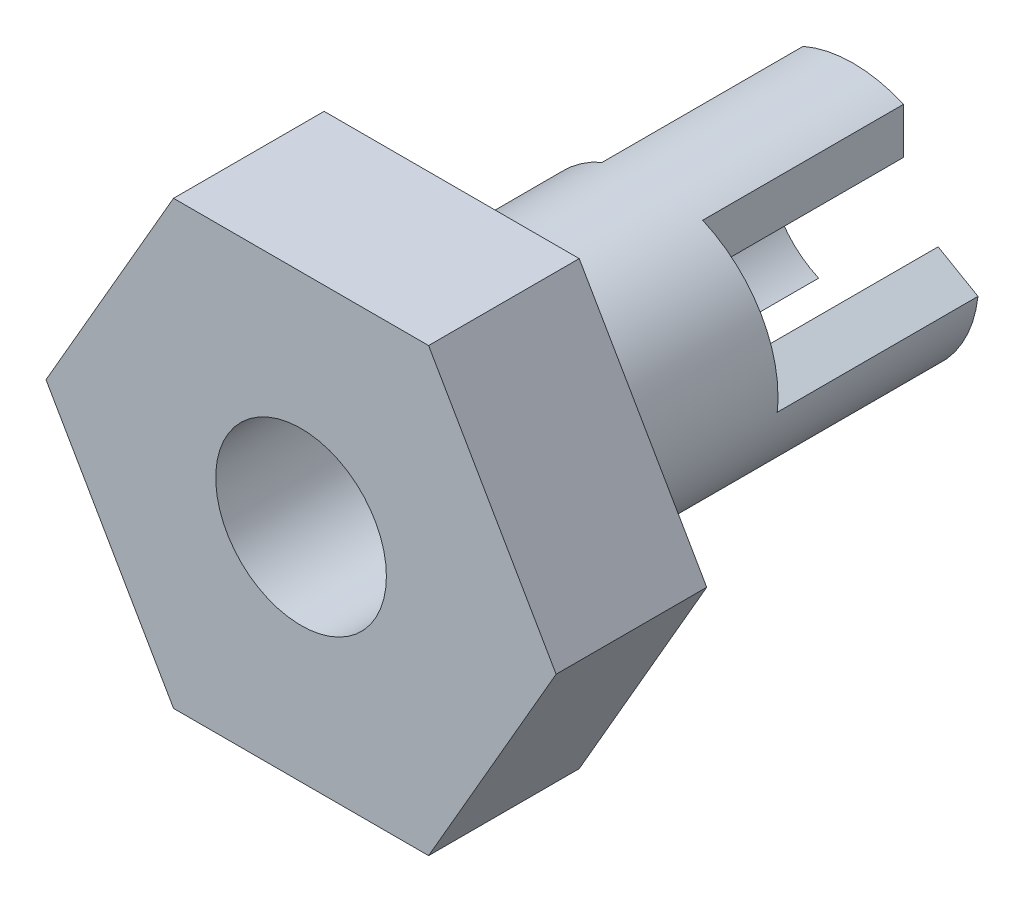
ISO-10303-21;
HEADER;
FILE_DESCRIPTION(('STEP AP214'),'2;1');
FILE_NAME('part.step','',(''),(''),'','','');
FILE_SCHEMA(('AUTOMOTIVE_DESIGN { 1 0 10303 214 1 1 1 1 }'));
ENDSEC;
DATA;
#1=APPLICATION_CONTEXT('core data for automotive mechanical design processes');
#2=APPLICATION_PROTOCOL_DEFINITION('international standard','automotive_design',2000,#1);
#3=PRODUCT_CONTEXT('',#1,'mechanical');
#4=PRODUCT('Part','Part','',(#3));
#5=PRODUCT_RELATED_PRODUCT_CATEGORY('part','',(#4));
#6=PRODUCT_DEFINITION_FORMATION('','',#4);
#7=PRODUCT_DEFINITION_CONTEXT('part definition',#1,'design');
#8=PRODUCT_DEFINITION('design','',#6,#7);
#9=PRODUCT_DEFINITION_SHAPE('','',#8);
#10=(LENGTH_UNIT() NAMED_UNIT(*) SI_UNIT(.MILLI.,.METRE.));
#11=(NAMED_UNIT(*) PLANE_ANGLE_UNIT() SI_UNIT($,.RADIAN.));
#12=(NAMED_UNIT(*) SI_UNIT($,.STERADIAN.) SOLID_ANGLE_UNIT());
#13=UNCERTAINTY_MEASURE_WITH_UNIT(LENGTH_MEASURE(1.E-05),#10,'distance_accuracy_value','');
#14=(GEOMETRIC_REPRESENTATION_CONTEXT(3) GLOBAL_UNCERTAINTY_ASSIGNED_CONTEXT((#13)) GLOBAL_UNIT_ASSIGNED_CONTEXT((#10,
#11,#12)) REPRESENTATION_CONTEXT('',''));
#15=CARTESIAN_POINT('',(0.,0.,0.));
#16=DIRECTION('',(0.,0.,1.));
#17=DIRECTION('',(1.,0.,0.));
#18=AXIS2_PLACEMENT_3D('',#15,#16,#17);
#19=CARTESIAN_POINT('',(0.,0.,-5.08));
#20=DIRECTION('',(0.,0.,-1.));
#21=DIRECTION('',(-1.,0.,0.));
#22=AXIS2_PLACEMENT_3D('',#19,#20,#21);
#23=PLANE('',#22);
#24=CARTESIAN_POINT('',(0.,0.,-5.08));
#25=DIRECTION('',(0.,0.,-1.));
#26=DIRECTION('',(-1.,0.,0.));
#27=AXIS2_PLACEMENT_3D('',#24,#25,#26);
#28=CIRCLE('',#27,3.175);
#29=CARTESIAN_POINT('',(1.27,2.90993556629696,-5.08));
#30=VERTEX_POINT('',#29);
#31=CARTESIAN_POINT('',(3.15507812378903,-0.355115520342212,-5.08));
#32=VERTEX_POINT('',#31);
#33=EDGE_CURVE('E248',#30,#32,#28,.T.);
#34=ORIENTED_EDGE('',*,*,#33,.T.);
#35=DIRECTION('',(0.86602540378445,-0.499999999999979,0.));
#36=VECTOR('',#35,1.);
#37=CARTESIAN_POINT('',(3.15507812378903,-0.355115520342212,-5.08));
#38=LINE('',#37,#36);
#39=CARTESIAN_POINT('',(2.14704687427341,0.226871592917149,-5.08));
#40=VERTEX_POINT('',#39);
#41=EDGE_CURVE('E56',#40,#32,#38,.T.);
#42=ORIENTED_EDGE('',*,*,#41,.F.);
#43=CARTESIAN_POINT('',(0.,0.,-5.08));
#44=DIRECTION('',(0.,0.,-1.));
#45=DIRECTION('',(-1.,0.,0.));
#46=AXIS2_PLACEMENT_3D('',#43,#44,#45);
#47=CIRCLE('',#46,2.159);
#48=CARTESIAN_POINT('',(1.27,1.74596133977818,-5.08));
#49=VERTEX_POINT('',#48);
#50=EDGE_CURVE('E183',#49,#40,#47,.T.);
#51=ORIENTED_EDGE('',*,*,#50,.F.);
#52=DIRECTION('',(0.,-1.,0.));
#53=VECTOR('',#52,1.);
#54=CARTESIAN_POINT('',(1.27,2.90993556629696,-5.08));
#55=LINE('',#54,#53);
#56=EDGE_CURVE('E187',#30,#49,#55,.T.);
#57=ORIENTED_EDGE('',*,*,#56,.F.);
#58=EDGE_LOOP('',(#34,#42,#51,#57));
#59=FACE_BOUND('',#58,.T.);
#60=ADVANCED_FACE('F33',(#59),#23,.T.);
#61=CARTESIAN_POINT('',(0.877046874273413,-1.97283293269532,-5.08));
#62=VERTEX_POINT('',#61);
#63=CARTESIAN_POINT('',(-0.877046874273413,-1.97283293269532,-5.08));
#64=VERTEX_POINT('',#63);
#65=EDGE_CURVE('E48',#62,#64,#47,.T.);
#66=ORIENTED_EDGE('',*,*,#65,.F.);
#67=DIRECTION('',(-0.866025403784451,0.499999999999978,0.));
#68=VECTOR('',#67,1.);
#69=CARTESIAN_POINT('',(1.88507812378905,-2.5548200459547,-5.08));
#70=LINE('',#69,#68);
#71=CARTESIAN_POINT('',(1.88507812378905,-2.5548200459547,-5.08));
#72=VERTEX_POINT('',#71);
#73=EDGE_CURVE('E178',#72,#62,#70,.T.);
#74=ORIENTED_EDGE('',*,*,#73,.F.);
#75=CARTESIAN_POINT('',(-1.88507812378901,-2.55482004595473,-5.08));
#76=VERTEX_POINT('',#75);
#77=EDGE_CURVE('E244',#72,#76,#28,.T.);
#78=ORIENTED_EDGE('',*,*,#77,.T.);
#79=DIRECTION('',(-0.866025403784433,-0.50000000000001,0.));
#80=VECTOR('',#79,1.);
#81=CARTESIAN_POINT('',(-1.88507812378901,-2.55482004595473,-5.08));
#82=LINE('',#81,#80);
#83=EDGE_CURVE('E215',#64,#76,#82,.T.);
#84=ORIENTED_EDGE('',*,*,#83,.F.);
#85=EDGE_LOOP('',(#66,#74,#78,#84));
#86=FACE_BOUND('',#85,.T.);
#87=ADVANCED_FACE('F333',(#86),#23,.T.);
#88=CARTESIAN_POINT('',(-3.15507812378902,-0.355115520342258,-5.08));
#89=VERTEX_POINT('',#88);
#90=CARTESIAN_POINT('',(-1.27,2.90993556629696,-5.08));
#91=VERTEX_POINT('',#90);
#92=EDGE_CURVE('E245',#89,#91,#28,.T.);
#93=ORIENTED_EDGE('',*,*,#92,.T.);
#94=DIRECTION('',(0.,1.,0.));
#95=VECTOR('',#94,1.);
#96=CARTESIAN_POINT('',(-1.27,2.90993556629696,-5.08));
#97=LINE('',#96,#95);
#98=CARTESIAN_POINT('',(-1.27,1.74596133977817,-5.08));
#99=VERTEX_POINT('',#98);
#100=EDGE_CURVE('E184',#99,#91,#97,.T.);
#101=ORIENTED_EDGE('',*,*,#100,.F.);
#102=CARTESIAN_POINT('',(-2.14704687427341,0.22687159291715,-5.08));
#103=VERTEX_POINT('',#102);
#104=EDGE_CURVE('E242',#103,#99,#47,.T.);
#105=ORIENTED_EDGE('',*,*,#104,.F.);
#106=DIRECTION('',(0.866025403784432,0.500000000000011,0.));
#107=VECTOR('',#106,1.);
#108=CARTESIAN_POINT('',(-3.15507812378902,-0.355115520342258,-5.08));
#109=LINE('',#108,#107);
#110=EDGE_CURVE('E220',#89,#103,#109,.T.);
#111=ORIENTED_EDGE('',*,*,#110,.F.);
#112=EDGE_LOOP('',(#93,#101,#105,#111));
#113=FACE_BOUND('',#112,.T.);
#114=ADVANCED_FACE('F335',(#113),#23,.T.);
#115=CARTESIAN_POINT('',(0.,0.,0.));
#116=DIRECTION('',(0.,0.,1.));
#117=DIRECTION('',(1.,0.,0.));
#118=AXIS2_PLACEMENT_3D('',#115,#116,#117);
#119=PLANE('',#118);
#120=DIRECTION('',(0.499999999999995,0.866025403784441,0.));
#121=VECTOR('',#120,1.);
#122=CARTESIAN_POINT('',(3.2262333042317,-5.58799999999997,0.));
#123=LINE('',#122,#121);
#124=CARTESIAN_POINT('',(3.2262333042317,-5.58799999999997,0.));
#125=VERTEX_POINT('',#124);
#126=CARTESIAN_POINT('',(6.45246660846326,0.,0.));
#127=VERTEX_POINT('',#126);
#128=EDGE_CURVE('E251',#125,#127,#123,.T.);
#129=ORIENTED_EDGE('',*,*,#128,.F.);
#130=DIRECTION('',(1.,0.,0.));
#131=VECTOR('',#130,1.);
#132=CARTESIAN_POINT('',(-3.22623330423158,-5.58800000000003,0.));
#133=LINE('',#132,#131);
#134=CARTESIAN_POINT('',(-3.22623330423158,-5.58800000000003,0.));
#135=VERTEX_POINT('',#134);
#136=EDGE_CURVE('E256',#135,#125,#133,.T.);
#137=ORIENTED_EDGE('',*,*,#136,.F.);
#138=DIRECTION('',(0.500000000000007,-0.866025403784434,0.));
#139=VECTOR('',#138,1.);
#140=CARTESIAN_POINT('',(-6.45246660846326,0.,0.));
#141=LINE('',#140,#139);
#142=CARTESIAN_POINT('',(-6.45246660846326,0.,0.));
#143=VERTEX_POINT('',#142);
#144=EDGE_CURVE('E275',#143,#135,#141,.T.);
#145=ORIENTED_EDGE('',*,*,#144,.F.);
#146=DIRECTION('',(-0.499999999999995,-0.866025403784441,0.));
#147=VECTOR('',#146,1.);
#148=CARTESIAN_POINT('',(-3.22623330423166,5.58799999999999,0.));
#149=LINE('',#148,#147);
#150=CARTESIAN_POINT('',(-3.22623330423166,5.58799999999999,0.));
#151=VERTEX_POINT('',#150);
#152=EDGE_CURVE('E273',#151,#143,#149,.T.);
#153=ORIENTED_EDGE('',*,*,#152,.F.);
#154=DIRECTION('',(-1.,0.,0.));
#155=VECTOR('',#154,1.);
#156=CARTESIAN_POINT('',(3.22623330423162,5.58800000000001,0.));
#157=LINE('',#156,#155);
#158=CARTESIAN_POINT('',(3.22623330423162,5.58800000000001,0.));
#159=VERTEX_POINT('',#158);
#160=EDGE_CURVE('E271',#159,#151,#157,.T.);
#161=ORIENTED_EDGE('',*,*,#160,.F.);
#162=DIRECTION('',(-0.500000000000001,0.866025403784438,0.));
#163=VECTOR('',#162,1.);
#164=CARTESIAN_POINT('',(6.45246660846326,0.,0.));
#165=LINE('',#164,#163);
#166=EDGE_CURVE('E269',#127,#159,#165,.T.);
#167=ORIENTED_EDGE('',*,*,#166,.F.);
#168=EDGE_LOOP('',(#129,#137,#145,#153,#161,#167));
#169=FACE_BOUND('',#168,.T.);
#170=CARTESIAN_POINT('',(0.,0.,0.));
#171=DIRECTION('',(0.,0.,1.));
#172=DIRECTION('',(1.,0.,0.));
#173=AXIS2_PLACEMENT_3D('',#170,#171,#172);
#174=CIRCLE('',#173,3.175);
#175=CARTESIAN_POINT('',(3.175,0.,0.));
#176=VERTEX_POINT('',#175);
#177=EDGE_CURVE('E11',#176,#176,#174,.F.);
#178=ORIENTED_EDGE('',*,*,#177,.F.);
#179=EDGE_LOOP('',(#178));
#180=FACE_BOUND('',#179,.T.);
#181=ADVANCED_FACE('F302',(#169,#180),#119,.F.);
#182=CARTESIAN_POINT('',(3.2262333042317,-5.58799999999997,3.81));
#183=DIRECTION('',(-0.866025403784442,0.499999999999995,0.));
#184=DIRECTION('',(-0.499999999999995,-0.866025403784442,0.));
#185=AXIS2_PLACEMENT_3D('',#182,#183,#184);
#186=PLANE('',#185);
#187=ORIENTED_EDGE('',*,*,#128,.T.);
#188=DIRECTION('',(0.,0.,-1.));
#189=VECTOR('',#188,1.);
#190=CARTESIAN_POINT('',(6.45246660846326,0.,3.81));
#191=LINE('',#190,#189);
#192=CARTESIAN_POINT('',(6.45246660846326,0.,3.81));
#193=VERTEX_POINT('',#192);
#194=EDGE_CURVE('E41',#193,#127,#191,.T.);
#195=ORIENTED_EDGE('',*,*,#194,.F.);
#196=DIRECTION('',(0.499999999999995,0.866025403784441,0.));
#197=VECTOR('',#196,1.);
#198=CARTESIAN_POINT('',(3.2262333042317,-5.58799999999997,3.81));
#199=LINE('',#198,#197);
#200=CARTESIAN_POINT('',(3.2262333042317,-5.58799999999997,3.81));
#201=VERTEX_POINT('',#200);
#202=EDGE_CURVE('E252',#201,#193,#199,.T.);
#203=ORIENTED_EDGE('',*,*,#202,.F.);
#204=DIRECTION('',(0.,0.,-1.));
#205=VECTOR('',#204,1.);
#206=CARTESIAN_POINT('',(3.2262333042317,-5.58799999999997,3.81));
#207=LINE('',#206,#205);
#208=EDGE_CURVE('E266',#201,#125,#207,.T.);
#209=ORIENTED_EDGE('',*,*,#208,.T.);
#210=EDGE_LOOP('',(#187,#195,#203,#209));
#211=FACE_BOUND('',#210,.T.);
#212=ADVANCED_FACE('F35',(#211),#186,.F.);
#213=CARTESIAN_POINT('',(6.45246660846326,0.,3.81));
#214=DIRECTION('',(-0.866025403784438,-0.500000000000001,0.));
#215=DIRECTION('',(0.500000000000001,-0.866025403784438,0.));
#216=AXIS2_PLACEMENT_3D('',#213,#214,#215);
#217=PLANE('',#216);
#218=ORIENTED_EDGE('',*,*,#166,.T.);
#219=DIRECTION('',(0.,0.,-1.));
#220=VECTOR('',#219,1.);
#221=CARTESIAN_POINT('',(3.22623330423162,5.58800000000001,3.81));
#222=LINE('',#221,#220);
#223=CARTESIAN_POINT('',(3.22623330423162,5.58800000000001,3.81));
#224=VERTEX_POINT('',#223);
#225=EDGE_CURVE('E289',#224,#159,#222,.T.);
#226=ORIENTED_EDGE('',*,*,#225,.F.);
#227=DIRECTION('',(-0.500000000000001,0.866025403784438,0.));
#228=VECTOR('',#227,1.);
#229=CARTESIAN_POINT('',(6.45246660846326,0.,3.81));
#230=LINE('',#229,#228);
#231=EDGE_CURVE('E255',#193,#224,#230,.T.);
#232=ORIENTED_EDGE('',*,*,#231,.F.);
#233=ORIENTED_EDGE('',*,*,#194,.T.);
#234=EDGE_LOOP('',(#218,#226,#232,#233));
#235=FACE_BOUND('',#234,.T.);
#236=ADVANCED_FACE('F294',(#235),#217,.F.);
#237=CARTESIAN_POINT('',(3.22623330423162,5.58800000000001,3.81));
#238=DIRECTION('',(0.,-1.,0.));
#239=DIRECTION('',(1.,0.,0.));
#240=AXIS2_PLACEMENT_3D('',#237,#238,#239);
#241=PLANE('',#240);
#242=ORIENTED_EDGE('',*,*,#160,.T.);
#243=DIRECTION('',(0.,0.,-1.));
#244=VECTOR('',#243,1.);
#245=CARTESIAN_POINT('',(-3.22623330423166,5.58799999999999,3.81));
#246=LINE('',#245,#244);
#247=CARTESIAN_POINT('',(-3.22623330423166,5.58799999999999,3.81));
#248=VERTEX_POINT('',#247);
#249=EDGE_CURVE('E286',#248,#151,#246,.T.);
#250=ORIENTED_EDGE('',*,*,#249,.F.);
#251=DIRECTION('',(-1.,0.,0.));
#252=VECTOR('',#251,1.);
#253=CARTESIAN_POINT('',(3.22623330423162,5.58800000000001,3.81));
#254=LINE('',#253,#252);
#255=EDGE_CURVE('E258',#224,#248,#254,.T.);
#256=ORIENTED_EDGE('',*,*,#255,.F.);
#257=ORIENTED_EDGE('',*,*,#225,.T.);
#258=EDGE_LOOP('',(#242,#250,#256,#257));
#259=FACE_BOUND('',#258,.T.);
#260=ADVANCED_FACE('F309',(#259),#241,.F.);
#261=CARTESIAN_POINT('',(-3.22623330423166,5.58799999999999,3.81));
#262=DIRECTION('',(0.866025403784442,-0.499999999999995,0.));
#263=DIRECTION('',(0.499999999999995,0.866025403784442,0.));
#264=AXIS2_PLACEMENT_3D('',#261,#262,#263);
#265=PLANE('',#264);
#266=ORIENTED_EDGE('',*,*,#152,.T.);
#267=DIRECTION('',(0.,0.,-1.));
#268=VECTOR('',#267,1.);
#269=CARTESIAN_POINT('',(-6.45246660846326,0.,3.81));
#270=LINE('',#269,#268);
#271=CARTESIAN_POINT('',(-6.45246660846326,0.,3.81));
#272=VERTEX_POINT('',#271);
#273=EDGE_CURVE('E283',#272,#143,#270,.T.);
#274=ORIENTED_EDGE('',*,*,#273,.F.);
#275=DIRECTION('',(-0.499999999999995,-0.866025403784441,0.));
#276=VECTOR('',#275,1.);
#277=CARTESIAN_POINT('',(-3.22623330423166,5.58799999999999,3.81));
#278=LINE('',#277,#276);
#279=EDGE_CURVE('E260',#248,#272,#278,.T.);
#280=ORIENTED_EDGE('',*,*,#279,.F.);
#281=ORIENTED_EDGE('',*,*,#249,.T.);
#282=EDGE_LOOP('',(#266,#274,#280,#281));
#283=FACE_BOUND('',#282,.T.);
#284=ADVANCED_FACE('F313',(#283),#265,.F.);
#285=CARTESIAN_POINT('',(-6.45246660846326,0.,3.81));
#286=DIRECTION('',(0.866025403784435,0.500000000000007,0.));
#287=DIRECTION('',(-0.500000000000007,0.866025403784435,0.));
#288=AXIS2_PLACEMENT_3D('',#285,#286,#287);
#289=PLANE('',#288);
#290=ORIENTED_EDGE('',*,*,#144,.T.);
#291=DIRECTION('',(0.,0.,-1.));
#292=VECTOR('',#291,1.);
#293=CARTESIAN_POINT('',(-3.22623330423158,-5.58800000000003,3.81));
#294=LINE('',#293,#292);
#295=CARTESIAN_POINT('',(-3.22623330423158,-5.58800000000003,3.81));
#296=VERTEX_POINT('',#295);
#297=EDGE_CURVE('E280',#296,#135,#294,.T.);
#298=ORIENTED_EDGE('',*,*,#297,.F.);
#299=DIRECTION('',(0.500000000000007,-0.866025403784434,0.));
#300=VECTOR('',#299,1.);
#301=CARTESIAN_POINT('',(-6.45246660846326,0.,3.81));
#302=LINE('',#301,#300);
#303=EDGE_CURVE('E262',#272,#296,#302,.T.);
#304=ORIENTED_EDGE('',*,*,#303,.F.);
#305=ORIENTED_EDGE('',*,*,#273,.T.);
#306=EDGE_LOOP('',(#290,#298,#304,#305));
#307=FACE_BOUND('',#306,.T.);
#308=ADVANCED_FACE('F323',(#307),#289,.F.);
#309=CARTESIAN_POINT('',(-3.22623330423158,-5.58800000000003,3.81));
#310=DIRECTION('',(0.,1.,0.));
#311=DIRECTION('',(-1.,0.,0.));
#312=AXIS2_PLACEMENT_3D('',#309,#310,#311);
#313=PLANE('',#312);
#314=ORIENTED_EDGE('',*,*,#136,.T.);
#315=ORIENTED_EDGE('',*,*,#208,.F.);
#316=DIRECTION('',(1.,0.,0.));
#317=VECTOR('',#316,1.);
#318=CARTESIAN_POINT('',(-3.22623330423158,-5.58800000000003,3.81));
#319=LINE('',#318,#317);
#320=EDGE_CURVE('E264',#296,#201,#319,.T.);
#321=ORIENTED_EDGE('',*,*,#320,.F.);
#322=ORIENTED_EDGE('',*,*,#297,.T.);
#323=EDGE_LOOP('',(#314,#315,#321,#322));
#324=FACE_BOUND('',#323,.T.);
#325=ADVANCED_FACE('F321',(#324),#313,.F.);
#326=CARTESIAN_POINT('',(0.,0.,3.81));
#327=DIRECTION('',(0.,0.,1.));
#328=DIRECTION('',(1.,0.,0.));
#329=AXIS2_PLACEMENT_3D('',#326,#327,#328);
#330=PLANE('',#329);
#331=CARTESIAN_POINT('',(0.,0.,3.81));
#332=DIRECTION('',(0.,0.,1.));
#333=DIRECTION('',(1.,0.,0.));
#334=AXIS2_PLACEMENT_3D('',#331,#332,#333);
#335=CIRCLE('',#334,2.159);
#336=CARTESIAN_POINT('',(2.159,0.,3.81));
#337=VERTEX_POINT('',#336);
#338=EDGE_CURVE('E247',#337,#337,#335,.T.);
#339=ORIENTED_EDGE('',*,*,#338,.F.);
#340=EDGE_LOOP('',(#339));
#341=FACE_BOUND('',#340,.T.);
#342=ORIENTED_EDGE('',*,*,#202,.T.);
#343=ORIENTED_EDGE('',*,*,#231,.T.);
#344=ORIENTED_EDGE('',*,*,#255,.T.);
#345=ORIENTED_EDGE('',*,*,#279,.T.);
#346=ORIENTED_EDGE('',*,*,#303,.T.);
#347=ORIENTED_EDGE('',*,*,#320,.T.);
#348=EDGE_LOOP('',(#342,#343,#344,#345,#346,#347));
#349=FACE_BOUND('',#348,.T.);
#350=ADVANCED_FACE('F317',(#341,#349),#330,.T.);
#351=CARTESIAN_POINT('',(0.,0.,0.));
#352=DIRECTION('',(0.,0.,1.));
#353=DIRECTION('',(1.,0.,0.));
#354=AXIS2_PLACEMENT_3D('',#351,#352,#353);
#355=CYLINDRICAL_SURFACE('',#354,2.159);
#356=ORIENTED_EDGE('',*,*,#338,.T.);
#357=EDGE_LOOP('',(#356));
#358=FACE_BOUND('',#357,.T.);
#359=ORIENTED_EDGE('',*,*,#104,.T.);
#360=DIRECTION('',(0.,0.,1.));
#361=VECTOR('',#360,1.);
#362=CARTESIAN_POINT('',(-1.27,1.74596133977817,-10.16));
#363=LINE('',#362,#361);
#364=CARTESIAN_POINT('',(-1.27,1.74596133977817,-10.16));
#365=VERTEX_POINT('',#364);
#366=EDGE_CURVE('E212',#365,#99,#363,.T.);
#367=ORIENTED_EDGE('',*,*,#366,.F.);
#368=CARTESIAN_POINT('',(0.,0.,-10.16));
#369=DIRECTION('',(0.,0.,1.));
#370=DIRECTION('',(-1.,0.,0.));
#371=AXIS2_PLACEMENT_3D('',#368,#369,#370);
#372=CIRCLE('',#371,2.159);
#373=CARTESIAN_POINT('',(1.27,1.74596133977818,-10.16));
#374=VERTEX_POINT('',#373);
#375=EDGE_CURVE('E193',#374,#365,#372,.T.);
#376=ORIENTED_EDGE('',*,*,#375,.F.);
#377=DIRECTION('',(0.,0.,1.));
#378=VECTOR('',#377,1.);
#379=CARTESIAN_POINT('',(1.27,1.74596133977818,-10.16));
#380=LINE('',#379,#378);
#381=EDGE_CURVE('E201',#374,#49,#380,.T.);
#382=ORIENTED_EDGE('',*,*,#381,.T.);
#383=ORIENTED_EDGE('',*,*,#50,.T.);
#384=DIRECTION('',(0.,0.,1.));
#385=VECTOR('',#384,1.);
#386=CARTESIAN_POINT('',(2.14704687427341,0.226871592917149,-10.16));
#387=LINE('',#386,#385);
#388=CARTESIAN_POINT('',(2.14704687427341,0.226871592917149,-10.16));
#389=VERTEX_POINT('',#388);
#390=EDGE_CURVE('E163',#389,#40,#387,.T.);
#391=ORIENTED_EDGE('',*,*,#390,.F.);
#392=CARTESIAN_POINT('',(0.,0.,-10.16));
#393=DIRECTION('',(0.,0.,1.));
#394=DIRECTION('',(-1.,0.,0.));
#395=AXIS2_PLACEMENT_3D('',#392,#393,#394);
#396=CIRCLE('',#395,2.159);
#397=CARTESIAN_POINT('',(0.877046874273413,-1.97283293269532,-10.16));
#398=VERTEX_POINT('',#397);
#399=EDGE_CURVE('E169',#398,#389,#396,.T.);
#400=ORIENTED_EDGE('',*,*,#399,.F.);
#401=DIRECTION('',(0.,0.,1.));
#402=VECTOR('',#401,1.);
#403=CARTESIAN_POINT('',(0.877046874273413,-1.97283293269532,-10.16));
#404=LINE('',#403,#402);
#405=EDGE_CURVE('E380',#398,#62,#404,.T.);
#406=ORIENTED_EDGE('',*,*,#405,.T.);
#407=ORIENTED_EDGE('',*,*,#65,.T.);
#408=DIRECTION('',(0.,0.,1.));
#409=VECTOR('',#408,1.);
#410=CARTESIAN_POINT('',(-0.877046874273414,-1.97283293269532,-10.16));
#411=LINE('',#410,#409);
#412=CARTESIAN_POINT('',(-0.877046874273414,-1.97283293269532,-10.16));
#413=VERTEX_POINT('',#412);
#414=EDGE_CURVE('E239',#413,#64,#411,.T.);
#415=ORIENTED_EDGE('',*,*,#414,.F.);
#416=CARTESIAN_POINT('',(0.,0.,-10.16));
#417=DIRECTION('',(0.,0.,1.));
#418=DIRECTION('',(-1.,0.,0.));
#419=AXIS2_PLACEMENT_3D('',#416,#417,#418);
#420=CIRCLE('',#419,2.159);
#421=CARTESIAN_POINT('',(-2.14704687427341,0.22687159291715,-10.16));
#422=VERTEX_POINT('',#421);
#423=EDGE_CURVE('E216',#422,#413,#420,.T.);
#424=ORIENTED_EDGE('',*,*,#423,.F.);
#425=DIRECTION('',(0.,0.,1.));
#426=VECTOR('',#425,1.);
#427=CARTESIAN_POINT('',(-2.14704687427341,0.22687159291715,-10.16));
#428=LINE('',#427,#426);
#429=EDGE_CURVE('E226',#422,#103,#428,.T.);
#430=ORIENTED_EDGE('',*,*,#429,.T.);
#431=EDGE_LOOP('',(#359,#367,#376,#382,#383,#391,#400,#406,#407,#415,#424,#430));
#432=FACE_BOUND('',#431,.T.);
#433=ADVANCED_FACE('F181',(#358,#432),#355,.F.);
#434=CARTESIAN_POINT('',(0.,0.,-5.08));
#435=DIRECTION('',(0.,0.,1.));
#436=DIRECTION('',(1.,0.,0.));
#437=AXIS2_PLACEMENT_3D('',#434,#435,#436);
#438=CYLINDRICAL_SURFACE('',#437,3.175);
#439=ORIENTED_EDGE('',*,*,#92,.F.);
#440=DIRECTION('',(0.,0.,1.));
#441=VECTOR('',#440,1.);
#442=CARTESIAN_POINT('',(-3.15507812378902,-0.355115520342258,-10.16));
#443=LINE('',#442,#441);
#444=CARTESIAN_POINT('',(-3.15507812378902,-0.355115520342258,-10.16));
#445=VERTEX_POINT('',#444);
#446=EDGE_CURVE('E233',#445,#89,#443,.T.);
#447=ORIENTED_EDGE('',*,*,#446,.F.);
#448=CARTESIAN_POINT('',(0.,0.,-10.16));
#449=DIRECTION('',(0.,0.,-1.));
#450=DIRECTION('',(-1.,0.,0.));
#451=AXIS2_PLACEMENT_3D('',#448,#449,#450);
#452=CIRCLE('',#451,3.175);
#453=CARTESIAN_POINT('',(-1.88507812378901,-2.55482004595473,-10.16));
#454=VERTEX_POINT('',#453);
#455=EDGE_CURVE('E222',#454,#445,#452,.T.);
#456=ORIENTED_EDGE('',*,*,#455,.F.);
#457=DIRECTION('',(0.,0.,1.));
#458=VECTOR('',#457,1.);
#459=CARTESIAN_POINT('',(-1.88507812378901,-2.55482004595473,-10.16));
#460=LINE('',#459,#458);
#461=EDGE_CURVE('E236',#454,#76,#460,.T.);
#462=ORIENTED_EDGE('',*,*,#461,.T.);
#463=ORIENTED_EDGE('',*,*,#77,.F.);
#464=DIRECTION('',(0.,0.,1.));
#465=VECTOR('',#464,1.);
#466=CARTESIAN_POINT('',(1.88507812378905,-2.5548200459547,-10.16));
#467=LINE('',#466,#465);
#468=CARTESIAN_POINT('',(1.88507812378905,-2.5548200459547,-10.16));
#469=VERTEX_POINT('',#468);
#470=EDGE_CURVE('E189',#469,#72,#467,.T.);
#471=ORIENTED_EDGE('',*,*,#470,.F.);
#472=CARTESIAN_POINT('',(0.,0.,-10.16));
#473=DIRECTION('',(0.,0.,-1.));
#474=DIRECTION('',(-1.,0.,0.));
#475=AXIS2_PLACEMENT_3D('',#472,#473,#474);
#476=CIRCLE('',#475,3.175);
#477=CARTESIAN_POINT('',(3.15507812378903,-0.355115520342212,-10.16));
#478=VERTEX_POINT('',#477);
#479=EDGE_CURVE('E168',#478,#469,#476,.T.);
#480=ORIENTED_EDGE('',*,*,#479,.F.);
#481=DIRECTION('',(0.,0.,1.));
#482=VECTOR('',#481,1.);
#483=CARTESIAN_POINT('',(3.15507812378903,-0.355115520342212,-10.16));
#484=LINE('',#483,#482);
#485=EDGE_CURVE('E165',#478,#32,#484,.T.);
#486=ORIENTED_EDGE('',*,*,#485,.T.);
#487=ORIENTED_EDGE('',*,*,#33,.F.);
#488=DIRECTION('',(0.,0.,1.));
#489=VECTOR('',#488,1.);
#490=CARTESIAN_POINT('',(1.27,2.90993556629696,-10.16));
#491=LINE('',#490,#489);
#492=CARTESIAN_POINT('',(1.27,2.90993556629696,-10.16));
#493=VERTEX_POINT('',#492);
#494=EDGE_CURVE('E206',#493,#30,#491,.T.);
#495=ORIENTED_EDGE('',*,*,#494,.F.);
#496=CARTESIAN_POINT('',(0.,0.,-10.16));
#497=DIRECTION('',(0.,0.,-1.));
#498=DIRECTION('',(-1.,0.,0.));
#499=AXIS2_PLACEMENT_3D('',#496,#497,#498);
#500=CIRCLE('',#499,3.175);
#501=CARTESIAN_POINT('',(-1.27,2.90993556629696,-10.16));
#502=VERTEX_POINT('',#501);
#503=EDGE_CURVE('E198',#502,#493,#500,.T.);
#504=ORIENTED_EDGE('',*,*,#503,.F.);
#505=DIRECTION('',(0.,0.,1.));
#506=VECTOR('',#505,1.);
#507=CARTESIAN_POINT('',(-1.27,2.90993556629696,-10.16));
#508=LINE('',#507,#506);
#509=EDGE_CURVE('E209',#502,#91,#508,.T.);
#510=ORIENTED_EDGE('',*,*,#509,.T.);
#511=EDGE_LOOP('',(#439,#447,#456,#462,#463,#471,#480,#486,#487,#495,#504,#510));
#512=FACE_BOUND('',#511,.T.);
#513=ORIENTED_EDGE('',*,*,#177,.T.);
#514=EDGE_LOOP('',(#513));
#515=FACE_BOUND('',#514,.T.);
#516=ADVANCED_FACE('F355',(#512,#515),#438,.T.);
#517=CARTESIAN_POINT('',(-1.88507812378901,-2.55482004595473,-10.16));
#518=DIRECTION('',(-0.50000000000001,0.866025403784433,0.));
#519=DIRECTION('',(-0.866025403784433,-0.50000000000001,0.));
#520=AXIS2_PLACEMENT_3D('',#517,#518,#519);
#521=PLANE('',#520);
#522=ORIENTED_EDGE('',*,*,#83,.T.);
#523=ORIENTED_EDGE('',*,*,#461,.F.);
#524=DIRECTION('',(-0.866025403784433,-0.50000000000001,0.));
#525=VECTOR('',#524,1.);
#526=CARTESIAN_POINT('',(-1.88507812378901,-2.55482004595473,-10.16));
#527=LINE('',#526,#525);
#528=EDGE_CURVE('E219',#413,#454,#527,.T.);
#529=ORIENTED_EDGE('',*,*,#528,.F.);
#530=ORIENTED_EDGE('',*,*,#414,.T.);
#531=EDGE_LOOP('',(#522,#523,#529,#530));
#532=FACE_BOUND('',#531,.T.);
#533=ADVANCED_FACE('F374',(#532),#521,.F.);
#534=CARTESIAN_POINT('',(-3.15507812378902,-0.355115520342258,-10.16));
#535=DIRECTION('',(0.500000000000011,-0.866025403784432,0.));
#536=DIRECTION('',(0.866025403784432,0.500000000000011,0.));
#537=AXIS2_PLACEMENT_3D('',#534,#535,#536);
#538=PLANE('',#537);
#539=ORIENTED_EDGE('',*,*,#110,.T.);
#540=ORIENTED_EDGE('',*,*,#429,.F.);
#541=DIRECTION('',(0.866025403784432,0.500000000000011,0.));
#542=VECTOR('',#541,1.);
#543=CARTESIAN_POINT('',(-3.15507812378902,-0.355115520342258,-10.16));
#544=LINE('',#543,#542);
#545=EDGE_CURVE('E224',#445,#422,#544,.T.);
#546=ORIENTED_EDGE('',*,*,#545,.F.);
#547=ORIENTED_EDGE('',*,*,#446,.T.);
#548=EDGE_LOOP('',(#539,#540,#546,#547));
#549=FACE_BOUND('',#548,.T.);
#550=ADVANCED_FACE('F366',(#549),#538,.F.);
#551=CARTESIAN_POINT('',(0.,0.,-10.16));
#552=DIRECTION('',(0.,0.,-1.));
#553=DIRECTION('',(-1.,0.,0.));
#554=AXIS2_PLACEMENT_3D('',#551,#552,#553);
#555=PLANE('',#554);
#556=ORIENTED_EDGE('',*,*,#423,.T.);
#557=ORIENTED_EDGE('',*,*,#528,.T.);
#558=ORIENTED_EDGE('',*,*,#455,.T.);
#559=ORIENTED_EDGE('',*,*,#545,.T.);
#560=EDGE_LOOP('',(#556,#557,#558,#559));
#561=FACE_BOUND('',#560,.T.);
#562=ADVANCED_FACE('F371',(#561),#555,.T.);
#563=CARTESIAN_POINT('',(-1.27,2.90993556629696,-10.16));
#564=DIRECTION('',(1.,0.,0.));
#565=DIRECTION('',(0.,0.,-1.));
#566=AXIS2_PLACEMENT_3D('',#563,#564,#565);
#567=PLANE('',#566);
#568=ORIENTED_EDGE('',*,*,#100,.T.);
#569=ORIENTED_EDGE('',*,*,#509,.F.);
#570=DIRECTION('',(0.,1.,0.));
#571=VECTOR('',#570,1.);
#572=CARTESIAN_POINT('',(-1.27,2.90993556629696,-10.16));
#573=LINE('',#572,#571);
#574=EDGE_CURVE('E196',#365,#502,#573,.T.);
#575=ORIENTED_EDGE('',*,*,#574,.F.);
#576=ORIENTED_EDGE('',*,*,#366,.T.);
#577=EDGE_LOOP('',(#568,#569,#575,#576));
#578=FACE_BOUND('',#577,.T.);
#579=ADVANCED_FACE('F352',(#578),#567,.F.);
#580=CARTESIAN_POINT('',(1.27,2.90993556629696,-10.16));
#581=DIRECTION('',(-1.,0.,0.));
#582=DIRECTION('',(0.,-1.,0.));
#583=AXIS2_PLACEMENT_3D('',#580,#581,#582);
#584=PLANE('',#583);
#585=ORIENTED_EDGE('',*,*,#56,.T.);
#586=ORIENTED_EDGE('',*,*,#381,.F.);
#587=DIRECTION('',(0.,-1.,0.));
#588=VECTOR('',#587,1.);
#589=CARTESIAN_POINT('',(1.27,2.90993556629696,-10.16));
#590=LINE('',#589,#588);
#591=EDGE_CURVE('E200',#493,#374,#590,.T.);
#592=ORIENTED_EDGE('',*,*,#591,.F.);
#593=ORIENTED_EDGE('',*,*,#494,.T.);
#594=EDGE_LOOP('',(#585,#586,#592,#593));
#595=FACE_BOUND('',#594,.T.);
#596=ADVANCED_FACE('F397',(#595),#584,.F.);
#597=CARTESIAN_POINT('',(0.,0.,-10.16));
#598=DIRECTION('',(0.,0.,-1.));
#599=DIRECTION('',(-1.,0.,0.));
#600=AXIS2_PLACEMENT_3D('',#597,#598,#599);
#601=PLANE('',#600);
#602=ORIENTED_EDGE('',*,*,#375,.T.);
#603=ORIENTED_EDGE('',*,*,#574,.T.);
#604=ORIENTED_EDGE('',*,*,#503,.T.);
#605=ORIENTED_EDGE('',*,*,#591,.T.);
#606=EDGE_LOOP('',(#602,#603,#604,#605));
#607=FACE_BOUND('',#606,.T.);
#608=ADVANCED_FACE('F360',(#607),#601,.T.);
#609=CARTESIAN_POINT('',(3.15507812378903,-0.355115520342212,-10.16));
#610=DIRECTION('',(-0.499999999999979,-0.86602540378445,0.));
#611=DIRECTION('',(0.866025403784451,-0.49999999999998,0.));
#612=AXIS2_PLACEMENT_3D('',#609,#610,#611);
#613=PLANE('',#612);
#614=ORIENTED_EDGE('',*,*,#41,.T.);
#615=ORIENTED_EDGE('',*,*,#485,.F.);
#616=DIRECTION('',(0.86602540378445,-0.499999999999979,0.));
#617=VECTOR('',#616,1.);
#618=CARTESIAN_POINT('',(3.15507812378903,-0.355115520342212,-10.16));
#619=LINE('',#618,#617);
#620=EDGE_CURVE('E159',#389,#478,#619,.T.);
#621=ORIENTED_EDGE('',*,*,#620,.F.);
#622=ORIENTED_EDGE('',*,*,#390,.T.);
#623=EDGE_LOOP('',(#614,#615,#621,#622));
#624=FACE_BOUND('',#623,.T.);
#625=ADVANCED_FACE('F161',(#624),#613,.F.);
#626=CARTESIAN_POINT('',(1.88507812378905,-2.5548200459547,-10.16));
#627=DIRECTION('',(0.499999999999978,0.866025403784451,0.));
#628=DIRECTION('',(-0.866025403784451,0.499999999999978,0.));
#629=AXIS2_PLACEMENT_3D('',#626,#627,#628);
#630=PLANE('',#629);
#631=ORIENTED_EDGE('',*,*,#73,.T.);
#632=ORIENTED_EDGE('',*,*,#405,.F.);
#633=DIRECTION('',(-0.866025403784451,0.499999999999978,0.));
#634=VECTOR('',#633,1.);
#635=CARTESIAN_POINT('',(1.88507812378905,-2.5548200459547,-10.16));
#636=LINE('',#635,#634);
#637=EDGE_CURVE('E174',#469,#398,#636,.T.);
#638=ORIENTED_EDGE('',*,*,#637,.F.);
#639=ORIENTED_EDGE('',*,*,#470,.T.);
#640=EDGE_LOOP('',(#631,#632,#638,#639));
#641=FACE_BOUND('',#640,.T.);
#642=ADVANCED_FACE('F385',(#641),#630,.F.);
#643=CARTESIAN_POINT('',(0.,0.,-10.16));
#644=DIRECTION('',(0.,0.,-1.));
#645=DIRECTION('',(-1.,0.,0.));
#646=AXIS2_PLACEMENT_3D('',#643,#644,#645);
#647=PLANE('',#646);
#648=ORIENTED_EDGE('',*,*,#399,.T.);
#649=ORIENTED_EDGE('',*,*,#620,.T.);
#650=ORIENTED_EDGE('',*,*,#479,.T.);
#651=ORIENTED_EDGE('',*,*,#637,.T.);
#652=EDGE_LOOP('',(#648,#649,#650,#651));
#653=FACE_BOUND('',#652,.T.);
#654=ADVANCED_FACE('F172',(#653),#647,.T.);
#655=CLOSED_SHELL('',(#60,#87,#114,#181,#212,#236,#260,#284,#308,#325,#350,#433,#516,#533,#550,
#562,#579,#596,#608,#625,#642,#654));
#656=MANIFOLD_SOLID_BREP('B2',#655);
#657=ADVANCED_BREP_SHAPE_REPRESENTATION('',(#18,#656),#14);
#658=SHAPE_DEFINITION_REPRESENTATION(#9,#657);
ENDSEC;
END-ISO-10303-21;
